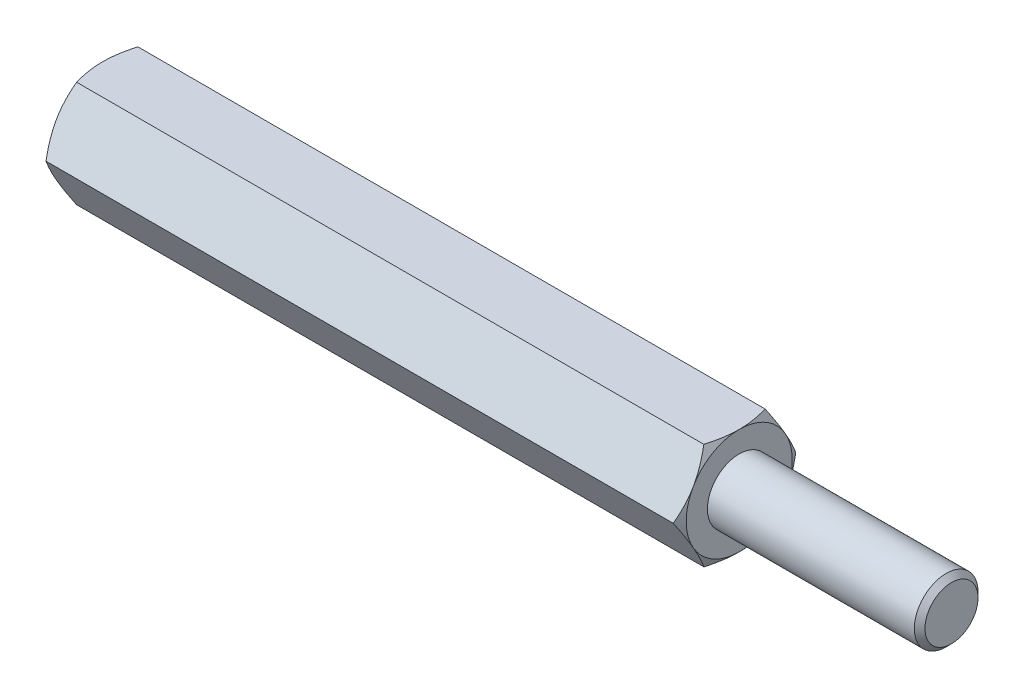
from build123d import *

# Parameters (mm, degrees)
EXTRUDE2_DEPTH = 15
SKETCH3_R      = 1.25
EXTRUDE3_DEPTH = 10
SKETCH5_R      = 1.5
EXTRUDE4_DEPTH = 10
CHAMFER1_SIZE  = 0.25


with BuildPart() as part:
    # Sketch1 → Extrude2 (new, symmetric)
    with BuildSketch(Plane(origin=(0, 0, 0), x_dir=(0, 0, -1), z_dir=(1, 0, 0))):
        Polygon((1.443375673, 2.5), (-1.443375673, 2.5), (-2.886751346, 0), (-1.443375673, -2.5), (1.443375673, -2.5), (2.886751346, 0), align=None)
    extrude(amount=EXTRUDE2_DEPTH, both=True)

    # Sketch2 → Cut-Revolve1 (revolve, cut)
    with BuildSketch(Plane.XY):
        with BuildLine():
            Line((-15, 2.5), (-13.5, 5.098076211))
            ThreePointArc((-13.5, 5.098076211), (-13.98810136, 6.276457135), (-15, 5.5))
            Line((-15, 5.5), (-15, 2.5))
        make_face()
    cut_revolve1 = revolve(axis=Axis((0, 0, 0), (1, 0, 0)), mode=Mode.SUBTRACT)

    # Mirror1: Cut-Revolve1 across plane
    add(cut_revolve1.mirror(Plane(origin=(0, 0, 0), x_dir=(0, 0, 1), z_dir=(1, 0, 0))), mode=Mode.SUBTRACT)

    # Sketch3 → Extrude3 (cut)
    with BuildSketch(Plane.ZY.offset(15)):
        Circle(SKETCH3_R)
    extrude(amount=-EXTRUDE3_DEPTH, mode=Mode.SUBTRACT)

    # Sketch4 → Cut-Revolve2 (revolve, cut)
    with BuildSketch(Plane.XY, mode=Mode.PRIVATE) as cut_revolve2_sk:
        Polygon((-5, 0), (-5, 1.25), (-4.278312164, 0), align=None)
    revolve(cut_revolve2_sk.sketch.rotate(Axis((-4.278312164, 0, 0), (-1, 0, 0)), 270), axis=Axis((-4.278312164, 0, 0), (-1, 0, 0)), mode=Mode.SUBTRACT)

    # Sketch5 → Extrude4 (add)
    with BuildSketch(Plane(origin=(15, 0, 0), x_dir=(0, 0, -1), z_dir=(1, 0, 0))):
        Circle(SKETCH5_R)
    extrude(amount=EXTRUDE4_DEPTH)

    # Chamfer1
    chamfer1_edges = [part.edges().sort_by_distance(p)[0] for p in [
        (25, 0, 1.5),
    ]]
    chamfer(chamfer1_edges, length=CHAMFER1_SIZE)


solid = part.part
